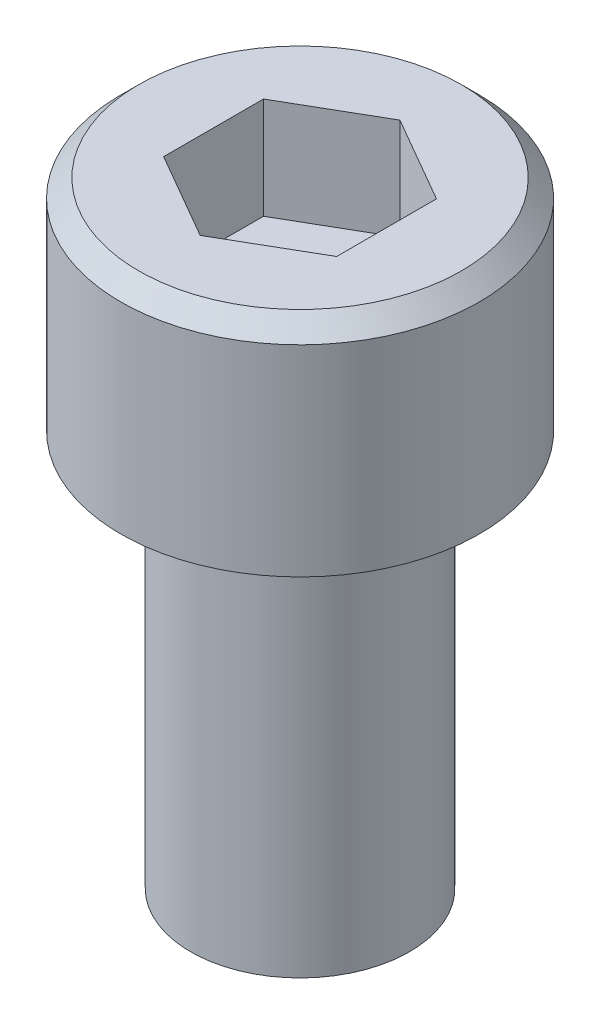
from build123d import *

# Parameters (mm, degrees)
SKETCH2_W          = 1.752598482
SKETCH2_H          = 6.3499945
CUT_EXTRUDE1_DEPTH = 1.625598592


with BuildPart() as part:
    # Sketch1 → Base-Revolve (revolve)
    with BuildSketch(Plane.XY, mode=Mode.PRIVATE) as base_revolve_sk:
        Polygon((0, 0), (2.870197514, 0), (2.870197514, 3.218177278), (2.583177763, 3.505196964), (0, 3.505196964), align=None)
    revolve(base_revolve_sk.sketch.rotate(Axis((0, 0, 0), (0, 1, 0)), 90), axis=Axis((0, 0, 0), (0, 1, 0)))

    # Sketch2 → Boss-Revolve1 (revolve)
    with BuildSketch(Plane.XY, mode=Mode.PRIVATE) as boss_revolve1_sk:
        with Locations((0.876299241, -3.17499725)):
            Rectangle(SKETCH2_W, SKETCH2_H)
    revolve(boss_revolve1_sk.sketch.rotate(Axis((0, 0, 0), (0, 1, 0)), 90), axis=Axis((0, 0, 0), (0, 1, 0)))

    # Sketch3 → Cut-Extrude1 (cut)
    with BuildSketch(Plane(origin=(0, 3.505196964, 0), x_dir=(-1, 0, 0), z_dir=(0, 1, 0))):
        Polygon((1.384298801, 0.799225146), (3.63e-07, 1.598450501), (-1.384298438, 0.799225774), (-1.384299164, -0.799224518), (-1.088e-06, -1.598450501), (1.384298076, -0.799226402), align=None)
    extrude(amount=-CUT_EXTRUDE1_DEPTH, mode=Mode.SUBTRACT)


solid = part.part
